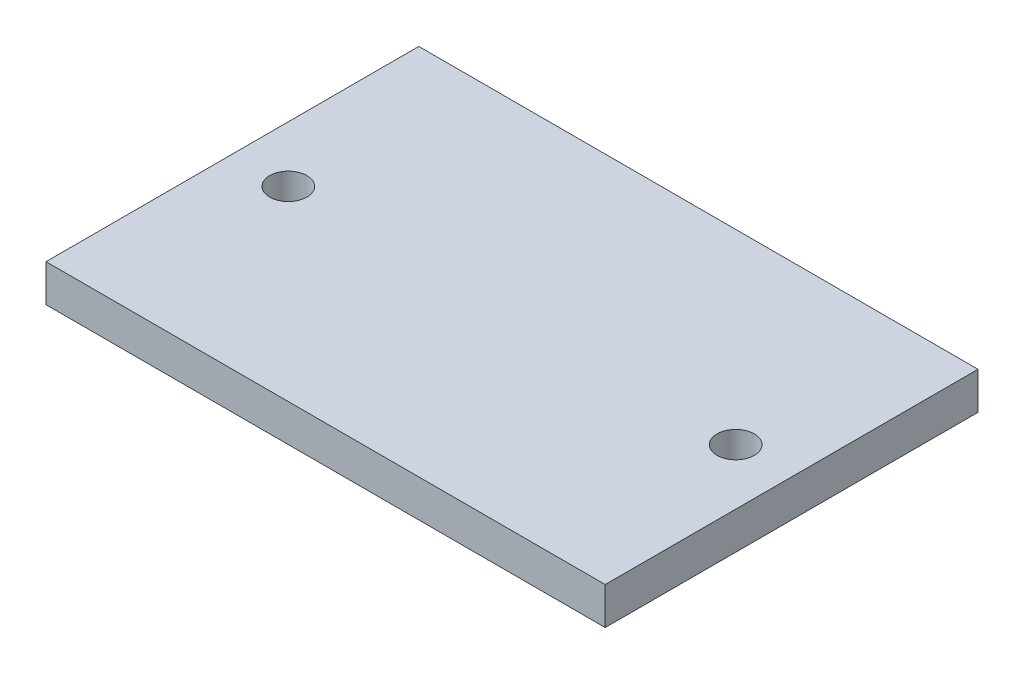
from build123d import *

# Parameters (mm, degrees)
SKETCH1_W          = 150
SKETCH1_H          = 100
EXTRUDE1_DEPTH     = 10
SKETCH3_R          = 5
CUT_EXTRUDE1_DEPTH = 91.691785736
LPATTERN1_COUNT    = 2
LPATTERN1_PITCH    = 120


with BuildPart() as part:
    # Sketch1 → Extrude1 (new body)
    with BuildSketch(Plane(origin=(0, 0, 0), x_dir=(1, 0, 0), z_dir=(0, 1, 0))):
        Rectangle(SKETCH1_W, SKETCH1_H)
    extrude(amount=EXTRUDE1_DEPTH)

    # Sketch3 → Cut-Extrude1 (cut, through all)
    with BuildSketch(Plane(origin=(0, 10, 0), x_dir=(-1, 0, 0), z_dir=(0, 1, 0))):
        with Locations(Location((60, 0, 0), (0, 0, 90))):
            Circle(SKETCH3_R)
    cut_extrude1 = extrude(amount=-CUT_EXTRUDE1_DEPTH, mode=Mode.SUBTRACT)

    # LPattern1: Cut-Extrude1 ×2
    with Locations(*[(i * LPATTERN1_PITCH, 0, 0) for i in range(1, LPATTERN1_COUNT)]):
        add(cut_extrude1, mode=Mode.SUBTRACT)


solid = part.part
